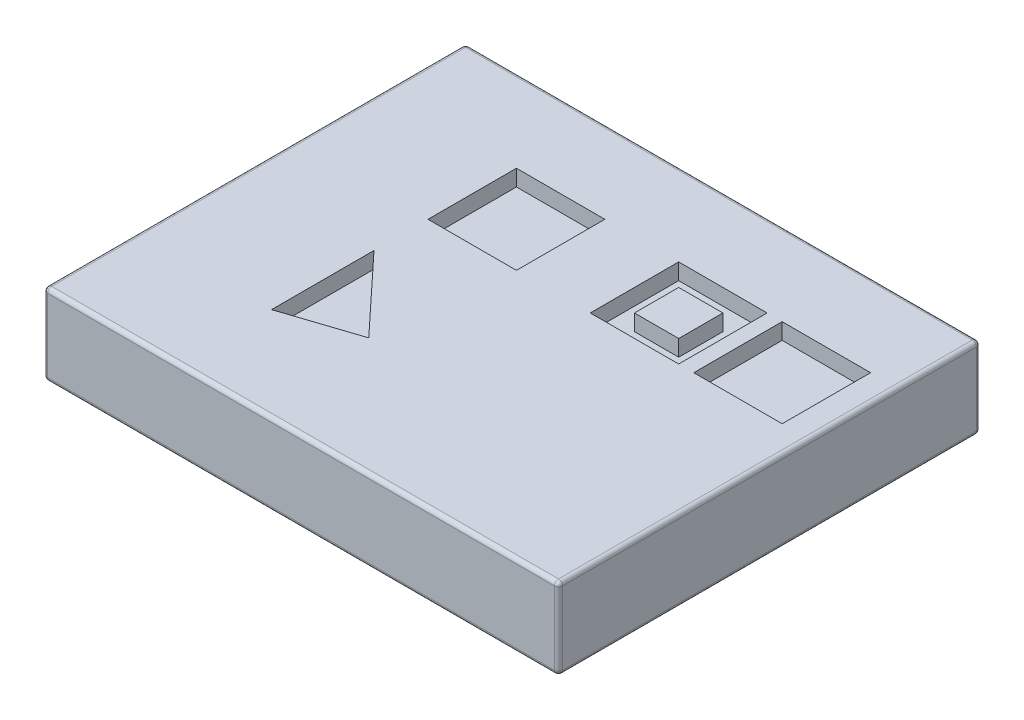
ISO-10303-21;
HEADER;
FILE_DESCRIPTION(('STEP AP214'),'2;1');
FILE_NAME('part.step','',(''),(''),'','','');
FILE_SCHEMA(('AUTOMOTIVE_DESIGN { 1 0 10303 214 1 1 1 1 }'));
ENDSEC;
DATA;
#1=APPLICATION_CONTEXT('core data for automotive mechanical design processes');
#2=APPLICATION_PROTOCOL_DEFINITION('international standard','automotive_design',2000,#1);
#3=PRODUCT_CONTEXT('',#1,'mechanical');
#4=PRODUCT('Part','Part','',(#3));
#5=PRODUCT_RELATED_PRODUCT_CATEGORY('part','',(#4));
#6=PRODUCT_DEFINITION_FORMATION('','',#4);
#7=PRODUCT_DEFINITION_CONTEXT('part definition',#1,'design');
#8=PRODUCT_DEFINITION('design','',#6,#7);
#9=PRODUCT_DEFINITION_SHAPE('','',#8);
#10=(LENGTH_UNIT() NAMED_UNIT(*) SI_UNIT(.MILLI.,.METRE.));
#11=(NAMED_UNIT(*) PLANE_ANGLE_UNIT() SI_UNIT($,.RADIAN.));
#12=(NAMED_UNIT(*) SI_UNIT($,.STERADIAN.) SOLID_ANGLE_UNIT());
#13=UNCERTAINTY_MEASURE_WITH_UNIT(LENGTH_MEASURE(1.E-05),#10,'distance_accuracy_value','');
#14=(GEOMETRIC_REPRESENTATION_CONTEXT(3) GLOBAL_UNCERTAINTY_ASSIGNED_CONTEXT((#13)) GLOBAL_UNIT_ASSIGNED_CONTEXT((#10,
#11,#12)) REPRESENTATION_CONTEXT('',''));
#15=CARTESIAN_POINT('',(0.,0.,0.));
#16=DIRECTION('',(0.,0.,1.));
#17=DIRECTION('',(1.,0.,0.));
#18=AXIS2_PLACEMENT_3D('',#15,#16,#17);
#19=CARTESIAN_POINT('',(0.,10.,-52.0063941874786));
#20=DIRECTION('',(1.,0.,0.));
#21=DIRECTION('',(0.,0.,-1.));
#22=AXIS2_PLACEMENT_3D('',#19,#20,#21);
#23=PLANE('',#22);
#24=DIRECTION('',(0.,0.,1.));
#25=VECTOR('',#24,1.);
#26=CARTESIAN_POINT('',(0.,9.5,-52.0063941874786));
#27=LINE('',#26,#25);
#28=CARTESIAN_POINT('',(0.,9.5,-0.5));
#29=VERTEX_POINT('',#28);
#30=CARTESIAN_POINT('',(0.,9.5,-51.5063941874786));
#31=VERTEX_POINT('',#30);
#32=EDGE_CURVE('E438',#29,#31,#27,.F.);
#33=ORIENTED_EDGE('',*,*,#32,.T.);
#34=DIRECTION('',(0.,-1.,0.));
#35=VECTOR('',#34,1.);
#36=CARTESIAN_POINT('',(0.,10.,-51.5063941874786));
#37=LINE('',#36,#35);
#38=CARTESIAN_POINT('',(0.,0.5,-51.5063941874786));
#39=VERTEX_POINT('',#38);
#40=EDGE_CURVE('E440',#31,#39,#37,.T.);
#41=ORIENTED_EDGE('',*,*,#40,.T.);
#42=DIRECTION('',(0.,0.,1.));
#43=VECTOR('',#42,1.);
#44=CARTESIAN_POINT('',(0.,0.5,-52.0063941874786));
#45=LINE('',#44,#43);
#46=CARTESIAN_POINT('',(0.,0.5,-0.5));
#47=VERTEX_POINT('',#46);
#48=EDGE_CURVE('E436',#39,#47,#45,.T.);
#49=ORIENTED_EDGE('',*,*,#48,.T.);
#50=DIRECTION('',(0.,-1.,0.));
#51=VECTOR('',#50,1.);
#52=CARTESIAN_POINT('',(0.,10.,-0.5));
#53=LINE('',#52,#51);
#54=EDGE_CURVE('E434',#47,#29,#53,.F.);
#55=ORIENTED_EDGE('',*,*,#54,.T.);
#56=EDGE_LOOP('',(#33,#41,#49,#55));
#57=FACE_BOUND('',#56,.T.);
#58=ADVANCED_FACE('F33',(#57),#23,.F.);
#59=CARTESIAN_POINT('',(0.,10.,0.));
#60=DIRECTION('',(0.,0.,-1.));
#61=DIRECTION('',(-1.,0.,0.));
#62=AXIS2_PLACEMENT_3D('',#59,#60,#61);
#63=PLANE('',#62);
#64=DIRECTION('',(1.,0.,0.));
#65=VECTOR('',#64,1.);
#66=CARTESIAN_POINT('',(0.,9.5,0.));
#67=LINE('',#66,#65);
#68=CARTESIAN_POINT('',(62.9654301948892,9.5,0.));
#69=VERTEX_POINT('',#68);
#70=CARTESIAN_POINT('',(0.5,9.5,0.));
#71=VERTEX_POINT('',#70);
#72=EDGE_CURVE('E42',#69,#71,#67,.F.);
#73=ORIENTED_EDGE('',*,*,#72,.T.);
#74=DIRECTION('',(0.,-1.,0.));
#75=VECTOR('',#74,1.);
#76=CARTESIAN_POINT('',(0.5,10.,0.));
#77=LINE('',#76,#75);
#78=CARTESIAN_POINT('',(0.5,0.5,0.));
#79=VERTEX_POINT('',#78);
#80=EDGE_CURVE('E11',#71,#79,#77,.T.);
#81=ORIENTED_EDGE('',*,*,#80,.T.);
#82=DIRECTION('',(1.,0.,0.));
#83=VECTOR('',#82,1.);
#84=CARTESIAN_POINT('',(0.,0.5,0.));
#85=LINE('',#84,#83);
#86=CARTESIAN_POINT('',(62.9654301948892,0.5,0.));
#87=VERTEX_POINT('',#86);
#88=EDGE_CURVE('E443',#79,#87,#85,.T.);
#89=ORIENTED_EDGE('',*,*,#88,.T.);
#90=DIRECTION('',(0.,-1.,0.));
#91=VECTOR('',#90,1.);
#92=CARTESIAN_POINT('',(62.9654301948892,10.,0.));
#93=LINE('',#92,#91);
#94=EDGE_CURVE('E53',#87,#69,#93,.F.);
#95=ORIENTED_EDGE('',*,*,#94,.T.);
#96=EDGE_LOOP('',(#73,#81,#89,#95));
#97=FACE_BOUND('',#96,.T.);
#98=ADVANCED_FACE('F528',(#97),#63,.F.);
#99=CARTESIAN_POINT('',(63.4654301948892,10.,0.));
#100=DIRECTION('',(-1.,0.,0.));
#101=DIRECTION('',(0.,0.,1.));
#102=AXIS2_PLACEMENT_3D('',#99,#100,#101);
#103=PLANE('',#102);
#104=DIRECTION('',(0.,0.,-1.));
#105=VECTOR('',#104,1.);
#106=CARTESIAN_POINT('',(63.4654301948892,0.5,0.));
#107=LINE('',#106,#105);
#108=CARTESIAN_POINT('',(63.4654301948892,0.5,-0.5));
#109=VERTEX_POINT('',#108);
#110=CARTESIAN_POINT('',(63.4654301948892,0.5,-51.5063941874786));
#111=VERTEX_POINT('',#110);
#112=EDGE_CURVE('E409',#109,#111,#107,.T.);
#113=ORIENTED_EDGE('',*,*,#112,.T.);
#114=DIRECTION('',(0.,-1.,0.));
#115=VECTOR('',#114,1.);
#116=CARTESIAN_POINT('',(63.4654301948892,10.,-51.5063941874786));
#117=LINE('',#116,#115);
#118=CARTESIAN_POINT('',(63.4654301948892,9.5,-51.5063941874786));
#119=VERTEX_POINT('',#118);
#120=EDGE_CURVE('E414',#111,#119,#117,.F.);
#121=ORIENTED_EDGE('',*,*,#120,.T.);
#122=DIRECTION('',(0.,0.,-1.));
#123=VECTOR('',#122,1.);
#124=CARTESIAN_POINT('',(63.4654301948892,9.5,0.));
#125=LINE('',#124,#123);
#126=CARTESIAN_POINT('',(63.4654301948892,9.5,-0.5));
#127=VERTEX_POINT('',#126);
#128=EDGE_CURVE('E411',#119,#127,#125,.F.);
#129=ORIENTED_EDGE('',*,*,#128,.T.);
#130=DIRECTION('',(0.,-1.,0.));
#131=VECTOR('',#130,1.);
#132=CARTESIAN_POINT('',(63.4654301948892,10.,-0.5));
#133=LINE('',#132,#131);
#134=EDGE_CURVE('E407',#127,#109,#133,.T.);
#135=ORIENTED_EDGE('',*,*,#134,.T.);
#136=EDGE_LOOP('',(#113,#121,#129,#135));
#137=FACE_BOUND('',#136,.T.);
#138=ADVANCED_FACE('F609',(#137),#103,.F.);
#139=CARTESIAN_POINT('',(63.4654301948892,10.,-52.0063941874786));
#140=DIRECTION('',(0.,0.,1.));
#141=DIRECTION('',(1.,0.,0.));
#142=AXIS2_PLACEMENT_3D('',#139,#140,#141);
#143=PLANE('',#142);
#144=DIRECTION('',(-1.,0.,0.));
#145=VECTOR('',#144,1.);
#146=CARTESIAN_POINT('',(63.4654301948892,9.5,-52.0063941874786));
#147=LINE('',#146,#145);
#148=CARTESIAN_POINT('',(0.5,9.5,-52.0063941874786));
#149=VERTEX_POINT('',#148);
#150=CARTESIAN_POINT('',(62.9654301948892,9.5,-52.0063941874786));
#151=VERTEX_POINT('',#150);
#152=EDGE_CURVE('E429',#149,#151,#147,.F.);
#153=ORIENTED_EDGE('',*,*,#152,.T.);
#154=DIRECTION('',(0.,-1.,0.));
#155=VECTOR('',#154,1.);
#156=CARTESIAN_POINT('',(62.9654301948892,10.,-52.0063941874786));
#157=LINE('',#156,#155);
#158=CARTESIAN_POINT('',(62.9654301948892,0.5,-52.0063941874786));
#159=VERTEX_POINT('',#158);
#160=EDGE_CURVE('E431',#151,#159,#157,.T.);
#161=ORIENTED_EDGE('',*,*,#160,.T.);
#162=DIRECTION('',(-1.,0.,0.));
#163=VECTOR('',#162,1.);
#164=CARTESIAN_POINT('',(63.4654301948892,0.5,-52.0063941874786));
#165=LINE('',#164,#163);
#166=CARTESIAN_POINT('',(0.5,0.5,-52.0063941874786));
#167=VERTEX_POINT('',#166);
#168=EDGE_CURVE('E427',#159,#167,#165,.T.);
#169=ORIENTED_EDGE('',*,*,#168,.T.);
#170=DIRECTION('',(0.,-1.,0.));
#171=VECTOR('',#170,1.);
#172=CARTESIAN_POINT('',(0.5,10.,-52.0063941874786));
#173=LINE('',#172,#171);
#174=EDGE_CURVE('E425',#167,#149,#173,.F.);
#175=ORIENTED_EDGE('',*,*,#174,.T.);
#176=EDGE_LOOP('',(#153,#161,#169,#175));
#177=FACE_BOUND('',#176,.T.);
#178=ADVANCED_FACE('F979',(#177),#143,.F.);
#179=CARTESIAN_POINT('',(0.,10.,0.));
#180=DIRECTION('',(0.,1.,0.));
#181=DIRECTION('',(0.,0.,1.));
#182=AXIS2_PLACEMENT_3D('',#179,#180,#181);
#183=PLANE('',#182);
#184=DIRECTION('',(1.,0.,0.));
#185=VECTOR('',#184,1.);
#186=CARTESIAN_POINT('',(63.4654301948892,10.,-0.5));
#187=LINE('',#186,#185);
#188=CARTESIAN_POINT('',(0.5,10.,-0.5));
#189=VERTEX_POINT('',#188);
#190=CARTESIAN_POINT('',(62.9654301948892,10.,-0.5));
#191=VERTEX_POINT('',#190);
#192=EDGE_CURVE('E392',#189,#191,#187,.T.);
#193=ORIENTED_EDGE('',*,*,#192,.T.);
#194=DIRECTION('',(0.,0.,-1.));
#195=VECTOR('',#194,1.);
#196=CARTESIAN_POINT('',(62.9654301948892,10.,-52.0063941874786));
#197=LINE('',#196,#195);
#198=CARTESIAN_POINT('',(62.9654301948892,10.,-51.5063941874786));
#199=VERTEX_POINT('',#198);
#200=EDGE_CURVE('E404',#191,#199,#197,.T.);
#201=ORIENTED_EDGE('',*,*,#200,.T.);
#202=DIRECTION('',(-1.,0.,0.));
#203=VECTOR('',#202,1.);
#204=CARTESIAN_POINT('',(0.,10.,-51.5063941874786));
#205=LINE('',#204,#203);
#206=CARTESIAN_POINT('',(0.5,10.,-51.5063941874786));
#207=VERTEX_POINT('',#206);
#208=EDGE_CURVE('E402',#199,#207,#205,.T.);
#209=ORIENTED_EDGE('',*,*,#208,.T.);
#210=DIRECTION('',(0.,0.,1.));
#211=VECTOR('',#210,1.);
#212=CARTESIAN_POINT('',(0.5,10.,0.));
#213=LINE('',#212,#211);
#214=EDGE_CURVE('E400',#207,#189,#213,.T.);
#215=ORIENTED_EDGE('',*,*,#214,.T.);
#216=EDGE_LOOP('',(#193,#201,#209,#215));
#217=FACE_BOUND('',#216,.T.);
#218=DIRECTION('',(-1.,0.,0.));
#219=VECTOR('',#218,1.);
#220=CARTESIAN_POINT('',(49.2891276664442,10.,-41.7479060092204));
#221=LINE('',#220,#219);
#222=CARTESIAN_POINT('',(60.1886709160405,10.,-41.7479060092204));
#223=VERTEX_POINT('',#222);
#224=CARTESIAN_POINT('',(49.2891276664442,10.,-41.7479060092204));
#225=VERTEX_POINT('',#224);
#226=EDGE_CURVE('E242',#223,#225,#221,.T.);
#227=ORIENTED_EDGE('',*,*,#226,.F.);
#228=DIRECTION('',(0.,0.,-1.));
#229=VECTOR('',#228,1.);
#230=CARTESIAN_POINT('',(60.1886709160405,10.,-41.7479060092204));
#231=LINE('',#230,#229);
#232=CARTESIAN_POINT('',(60.1886709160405,10.,-30.8483627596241));
#233=VERTEX_POINT('',#232);
#234=EDGE_CURVE('E259',#233,#223,#231,.T.);
#235=ORIENTED_EDGE('',*,*,#234,.F.);
#236=DIRECTION('',(1.,0.,0.));
#237=VECTOR('',#236,1.);
#238=CARTESIAN_POINT('',(60.1886709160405,10.,-30.8483627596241));
#239=LINE('',#238,#237);
#240=CARTESIAN_POINT('',(49.2891276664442,10.,-30.8483627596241));
#241=VERTEX_POINT('',#240);
#242=EDGE_CURVE('E262',#241,#233,#239,.T.);
#243=ORIENTED_EDGE('',*,*,#242,.F.);
#244=DIRECTION('',(0.,0.,1.));
#245=VECTOR('',#244,1.);
#246=CARTESIAN_POINT('',(49.2891276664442,10.,-30.8483627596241));
#247=LINE('',#246,#245);
#248=EDGE_CURVE('E268',#225,#241,#247,.T.);
#249=ORIENTED_EDGE('',*,*,#248,.F.);
#250=EDGE_LOOP('',(#227,#235,#243,#249));
#251=FACE_BOUND('',#250,.T.);
#252=DIRECTION('',(0.,0.,1.));
#253=VECTOR('',#252,1.);
#254=CARTESIAN_POINT('',(36.5347862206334,10.,-30.8483627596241));
#255=LINE('',#254,#253);
#256=CARTESIAN_POINT('',(36.5347862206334,10.,-41.7479060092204));
#257=VERTEX_POINT('',#256);
#258=CARTESIAN_POINT('',(36.5347862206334,10.,-30.8483627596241));
#259=VERTEX_POINT('',#258);
#260=EDGE_CURVE('E304',#257,#259,#255,.T.);
#261=ORIENTED_EDGE('',*,*,#260,.F.);
#262=DIRECTION('',(-1.,0.,0.));
#263=VECTOR('',#262,1.);
#264=CARTESIAN_POINT('',(36.5347862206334,10.,-41.7479060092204));
#265=LINE('',#264,#263);
#266=CARTESIAN_POINT('',(47.4343294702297,10.,-41.7479060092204));
#267=VERTEX_POINT('',#266);
#268=EDGE_CURVE('E315',#267,#257,#265,.T.);
#269=ORIENTED_EDGE('',*,*,#268,.F.);
#270=DIRECTION('',(0.,0.,-1.));
#271=VECTOR('',#270,1.);
#272=CARTESIAN_POINT('',(47.4343294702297,10.,-41.7479060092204));
#273=LINE('',#272,#271);
#274=CARTESIAN_POINT('',(47.4343294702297,10.,-30.8483627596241));
#275=VERTEX_POINT('',#274);
#276=EDGE_CURVE('E329',#275,#267,#273,.T.);
#277=ORIENTED_EDGE('',*,*,#276,.F.);
#278=DIRECTION('',(1.,0.,0.));
#279=VECTOR('',#278,1.);
#280=CARTESIAN_POINT('',(47.4343294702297,10.,-30.8483627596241));
#281=LINE('',#280,#279);
#282=EDGE_CURVE('E326',#259,#275,#281,.T.);
#283=ORIENTED_EDGE('',*,*,#282,.F.);
#284=EDGE_LOOP('',(#261,#269,#277,#283));
#285=FACE_BOUND('',#284,.T.);
#286=DIRECTION('',(0.949483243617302,0.,-0.313817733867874));
#287=VECTOR('',#286,1.);
#288=CARTESIAN_POINT('',(25.5381401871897,10.,-14.5382504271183));
#289=LINE('',#288,#287);
#290=CARTESIAN_POINT('',(16.5347862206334,10.,-11.5625137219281));
#291=VERTEX_POINT('',#290);
#292=CARTESIAN_POINT('',(25.5381401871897,10.,-14.5382504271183));
#293=VERTEX_POINT('',#292);
#294=EDGE_CURVE('E336',#291,#293,#289,.T.);
#295=ORIENTED_EDGE('',*,*,#294,.F.);
#296=DIRECTION('',(0.,0.,1.));
#297=VECTOR('',#296,1.);
#298=CARTESIAN_POINT('',(16.5347862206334,10.,-11.5625137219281));
#299=LINE('',#298,#297);
#300=CARTESIAN_POINT('',(16.5347862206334,10.,-24.1912873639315));
#301=VERTEX_POINT('',#300);
#302=EDGE_CURVE('E347',#301,#291,#299,.T.);
#303=ORIENTED_EDGE('',*,*,#302,.F.);
#304=DIRECTION('',(-0.682069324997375,0.,-0.731287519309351));
#305=VECTOR('',#304,1.);
#306=CARTESIAN_POINT('',(16.5347862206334,10.,-24.1912873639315));
#307=LINE('',#306,#305);
#308=EDGE_CURVE('E355',#293,#301,#307,.T.);
#309=ORIENTED_EDGE('',*,*,#308,.F.);
#310=EDGE_LOOP('',(#295,#303,#309));
#311=FACE_BOUND('',#310,.T.);
#312=DIRECTION('',(0.,0.,1.));
#313=VECTOR('',#312,1.);
#314=CARTESIAN_POINT('',(16.5347862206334,10.,-30.8483627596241));
#315=LINE('',#314,#313);
#316=CARTESIAN_POINT('',(16.5347862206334,10.,-41.7479060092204));
#317=VERTEX_POINT('',#316);
#318=CARTESIAN_POINT('',(16.5347862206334,10.,-30.8483627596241));
#319=VERTEX_POINT('',#318);
#320=EDGE_CURVE('E362',#317,#319,#315,.T.);
#321=ORIENTED_EDGE('',*,*,#320,.F.);
#322=DIRECTION('',(-1.,0.,0.));
#323=VECTOR('',#322,1.);
#324=CARTESIAN_POINT('',(16.5347862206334,10.,-41.7479060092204));
#325=LINE('',#324,#323);
#326=CARTESIAN_POINT('',(27.4343294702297,10.,-41.7479060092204));
#327=VERTEX_POINT('',#326);
#328=EDGE_CURVE('E371',#327,#317,#325,.T.);
#329=ORIENTED_EDGE('',*,*,#328,.F.);
#330=DIRECTION('',(0.,0.,-1.));
#331=VECTOR('',#330,1.);
#332=CARTESIAN_POINT('',(27.4343294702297,10.,-41.7479060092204));
#333=LINE('',#332,#331);
#334=CARTESIAN_POINT('',(27.4343294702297,10.,-30.8483627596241));
#335=VERTEX_POINT('',#334);
#336=EDGE_CURVE('E385',#335,#327,#333,.T.);
#337=ORIENTED_EDGE('',*,*,#336,.F.);
#338=DIRECTION('',(1.,0.,0.));
#339=VECTOR('',#338,1.);
#340=CARTESIAN_POINT('',(27.4343294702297,10.,-30.8483627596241));
#341=LINE('',#340,#339);
#342=EDGE_CURVE('E382',#319,#335,#341,.T.);
#343=ORIENTED_EDGE('',*,*,#342,.F.);
#344=EDGE_LOOP('',(#321,#329,#337,#343));
#345=FACE_BOUND('',#344,.T.);
#346=ADVANCED_FACE('F543',(#217,#251,#285,#311,#345),#183,.T.);
#347=CARTESIAN_POINT('',(0.,0.,0.));
#348=DIRECTION('',(0.,1.,0.));
#349=DIRECTION('',(0.,0.,1.));
#350=AXIS2_PLACEMENT_3D('',#347,#348,#349);
#351=PLANE('',#350);
#352=DIRECTION('',(-1.,0.,0.));
#353=VECTOR('',#352,1.);
#354=CARTESIAN_POINT('',(0.,0.,-51.5063941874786));
#355=LINE('',#354,#353);
#356=CARTESIAN_POINT('',(0.5,0.,-51.5063941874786));
#357=VERTEX_POINT('',#356);
#358=CARTESIAN_POINT('',(62.9654301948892,0.,-51.5063941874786));
#359=VERTEX_POINT('',#358);
#360=EDGE_CURVE('E420',#357,#359,#355,.F.);
#361=ORIENTED_EDGE('',*,*,#360,.T.);
#362=DIRECTION('',(0.,0.,-1.));
#363=VECTOR('',#362,1.);
#364=CARTESIAN_POINT('',(62.9654301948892,0.,0.));
#365=LINE('',#364,#363);
#366=CARTESIAN_POINT('',(62.9654301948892,0.,-0.5));
#367=VERTEX_POINT('',#366);
#368=EDGE_CURVE('E422',#359,#367,#365,.F.);
#369=ORIENTED_EDGE('',*,*,#368,.T.);
#370=DIRECTION('',(1.,0.,0.));
#371=VECTOR('',#370,1.);
#372=CARTESIAN_POINT('',(0.,0.,-0.5));
#373=LINE('',#372,#371);
#374=CARTESIAN_POINT('',(0.5,0.,-0.5));
#375=VERTEX_POINT('',#374);
#376=EDGE_CURVE('E416',#367,#375,#373,.F.);
#377=ORIENTED_EDGE('',*,*,#376,.T.);
#378=DIRECTION('',(0.,0.,1.));
#379=VECTOR('',#378,1.);
#380=CARTESIAN_POINT('',(0.5,0.,0.));
#381=LINE('',#380,#379);
#382=EDGE_CURVE('E418',#375,#357,#381,.F.);
#383=ORIENTED_EDGE('',*,*,#382,.T.);
#384=EDGE_LOOP('',(#361,#369,#377,#383));
#385=FACE_BOUND('',#384,.T.);
#386=ADVANCED_FACE('F567',(#385),#351,.F.);
#387=CARTESIAN_POINT('',(16.5347862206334,8.,-30.8483627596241));
#388=DIRECTION('',(-1.,0.,0.));
#389=DIRECTION('',(0.,0.,1.));
#390=AXIS2_PLACEMENT_3D('',#387,#388,#389);
#391=PLANE('',#390);
#392=ORIENTED_EDGE('',*,*,#320,.T.);
#393=DIRECTION('',(0.,1.,0.));
#394=VECTOR('',#393,1.);
#395=CARTESIAN_POINT('',(16.5347862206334,8.,-30.8483627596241));
#396=LINE('',#395,#394);
#397=CARTESIAN_POINT('',(16.5347862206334,8.,-30.8483627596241));
#398=VERTEX_POINT('',#397);
#399=EDGE_CURVE('E380',#398,#319,#396,.T.);
#400=ORIENTED_EDGE('',*,*,#399,.F.);
#401=DIRECTION('',(0.,0.,1.));
#402=VECTOR('',#401,1.);
#403=CARTESIAN_POINT('',(16.5347862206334,8.,-30.8483627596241));
#404=LINE('',#403,#402);
#405=CARTESIAN_POINT('',(16.5347862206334,8.,-41.7479060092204));
#406=VERTEX_POINT('',#405);
#407=EDGE_CURVE('E367',#406,#398,#404,.T.);
#408=ORIENTED_EDGE('',*,*,#407,.F.);
#409=DIRECTION('',(0.,1.,0.));
#410=VECTOR('',#409,1.);
#411=CARTESIAN_POINT('',(16.5347862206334,8.,-41.7479060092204));
#412=LINE('',#411,#410);
#413=EDGE_CURVE('E390',#406,#317,#412,.T.);
#414=ORIENTED_EDGE('',*,*,#413,.T.);
#415=EDGE_LOOP('',(#392,#400,#408,#414));
#416=FACE_BOUND('',#415,.T.);
#417=ADVANCED_FACE('F949',(#416),#391,.F.);
#418=CARTESIAN_POINT('',(16.5347862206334,8.,-41.7479060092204));
#419=DIRECTION('',(0.,0.,-1.));
#420=DIRECTION('',(-1.,0.,0.));
#421=AXIS2_PLACEMENT_3D('',#418,#419,#420);
#422=PLANE('',#421);
#423=ORIENTED_EDGE('',*,*,#328,.T.);
#424=ORIENTED_EDGE('',*,*,#413,.F.);
#425=DIRECTION('',(-1.,0.,0.));
#426=VECTOR('',#425,1.);
#427=CARTESIAN_POINT('',(16.5347862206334,8.,-41.7479060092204));
#428=LINE('',#427,#426);
#429=CARTESIAN_POINT('',(27.4343294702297,8.,-41.7479060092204));
#430=VERTEX_POINT('',#429);
#431=EDGE_CURVE('E377',#430,#406,#428,.T.);
#432=ORIENTED_EDGE('',*,*,#431,.F.);
#433=DIRECTION('',(0.,1.,0.));
#434=VECTOR('',#433,1.);
#435=CARTESIAN_POINT('',(27.4343294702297,8.,-41.7479060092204));
#436=LINE('',#435,#434);
#437=EDGE_CURVE('E393',#430,#327,#436,.T.);
#438=ORIENTED_EDGE('',*,*,#437,.T.);
#439=EDGE_LOOP('',(#423,#424,#432,#438));
#440=FACE_BOUND('',#439,.T.);
#441=ADVANCED_FACE('F940',(#440),#422,.F.);
#442=CARTESIAN_POINT('',(27.4343294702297,8.,-41.7479060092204));
#443=DIRECTION('',(1.,0.,0.));
#444=DIRECTION('',(0.,0.,-1.));
#445=AXIS2_PLACEMENT_3D('',#442,#443,#444);
#446=PLANE('',#445);
#447=ORIENTED_EDGE('',*,*,#336,.T.);
#448=ORIENTED_EDGE('',*,*,#437,.F.);
#449=DIRECTION('',(0.,0.,-1.));
#450=VECTOR('',#449,1.);
#451=CARTESIAN_POINT('',(27.4343294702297,8.,-41.7479060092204));
#452=LINE('',#451,#450);
#453=CARTESIAN_POINT('',(27.4343294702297,8.,-30.8483627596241));
#454=VERTEX_POINT('',#453);
#455=EDGE_CURVE('E374',#454,#430,#452,.T.);
#456=ORIENTED_EDGE('',*,*,#455,.F.);
#457=DIRECTION('',(0.,1.,0.));
#458=VECTOR('',#457,1.);
#459=CARTESIAN_POINT('',(27.4343294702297,8.,-30.8483627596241));
#460=LINE('',#459,#458);
#461=EDGE_CURVE('E395',#454,#335,#460,.T.);
#462=ORIENTED_EDGE('',*,*,#461,.T.);
#463=EDGE_LOOP('',(#447,#448,#456,#462));
#464=FACE_BOUND('',#463,.T.);
#465=ADVANCED_FACE('F931',(#464),#446,.F.);
#466=CARTESIAN_POINT('',(27.4343294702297,8.,-30.8483627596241));
#467=DIRECTION('',(0.,0.,1.));
#468=DIRECTION('',(1.,0.,0.));
#469=AXIS2_PLACEMENT_3D('',#466,#467,#468);
#470=PLANE('',#469);
#471=ORIENTED_EDGE('',*,*,#342,.T.);
#472=ORIENTED_EDGE('',*,*,#461,.F.);
#473=DIRECTION('',(1.,0.,0.));
#474=VECTOR('',#473,1.);
#475=CARTESIAN_POINT('',(27.4343294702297,8.,-30.8483627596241));
#476=LINE('',#475,#474);
#477=EDGE_CURVE('E370',#398,#454,#476,.T.);
#478=ORIENTED_EDGE('',*,*,#477,.F.);
#479=ORIENTED_EDGE('',*,*,#399,.T.);
#480=EDGE_LOOP('',(#471,#472,#478,#479));
#481=FACE_BOUND('',#480,.T.);
#482=ADVANCED_FACE('F922',(#481),#470,.F.);
#483=CARTESIAN_POINT('',(0.,8.,0.));
#484=DIRECTION('',(0.,-1.,0.));
#485=DIRECTION('',(0.,0.,-1.));
#486=AXIS2_PLACEMENT_3D('',#483,#484,#485);
#487=PLANE('',#486);
#488=ORIENTED_EDGE('',*,*,#407,.T.);
#489=ORIENTED_EDGE('',*,*,#477,.T.);
#490=ORIENTED_EDGE('',*,*,#455,.T.);
#491=ORIENTED_EDGE('',*,*,#431,.T.);
#492=EDGE_LOOP('',(#488,#489,#490,#491));
#493=FACE_BOUND('',#492,.T.);
#494=ADVANCED_FACE('F913',(#493),#487,.F.);
#495=CARTESIAN_POINT('',(25.5381401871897,8.,-14.5382504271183));
#496=DIRECTION('',(0.313817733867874,0.,0.949483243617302));
#497=DIRECTION('',(0.949483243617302,0.,-0.313817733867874));
#498=AXIS2_PLACEMENT_3D('',#495,#496,#497);
#499=PLANE('',#498);
#500=ORIENTED_EDGE('',*,*,#294,.T.);
#501=DIRECTION('',(0.,1.,0.));
#502=VECTOR('',#501,1.);
#503=CARTESIAN_POINT('',(25.5381401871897,8.,-14.5382504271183));
#504=LINE('',#503,#502);
#505=CARTESIAN_POINT('',(25.5381401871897,8.,-14.5382504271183));
#506=VERTEX_POINT('',#505);
#507=EDGE_CURVE('E353',#506,#293,#504,.T.);
#508=ORIENTED_EDGE('',*,*,#507,.F.);
#509=DIRECTION('',(0.949483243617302,0.,-0.313817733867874));
#510=VECTOR('',#509,1.);
#511=CARTESIAN_POINT('',(25.5381401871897,8.,-14.5382504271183));
#512=LINE('',#511,#510);
#513=CARTESIAN_POINT('',(16.5347862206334,8.,-11.5625137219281));
#514=VERTEX_POINT('',#513);
#515=EDGE_CURVE('E343',#514,#506,#512,.T.);
#516=ORIENTED_EDGE('',*,*,#515,.F.);
#517=DIRECTION('',(0.,1.,0.));
#518=VECTOR('',#517,1.);
#519=CARTESIAN_POINT('',(16.5347862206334,8.,-11.5625137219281));
#520=LINE('',#519,#518);
#521=EDGE_CURVE('E360',#514,#291,#520,.T.);
#522=ORIENTED_EDGE('',*,*,#521,.T.);
#523=EDGE_LOOP('',(#500,#508,#516,#522));
#524=FACE_BOUND('',#523,.T.);
#525=ADVANCED_FACE('F904',(#524),#499,.F.);
#526=CARTESIAN_POINT('',(16.5347862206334,8.,-11.5625137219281));
#527=DIRECTION('',(-1.,0.,0.));
#528=DIRECTION('',(0.,0.,1.));
#529=AXIS2_PLACEMENT_3D('',#526,#527,#528);
#530=PLANE('',#529);
#531=ORIENTED_EDGE('',*,*,#302,.T.);
#532=ORIENTED_EDGE('',*,*,#521,.F.);
#533=DIRECTION('',(0.,0.,1.));
#534=VECTOR('',#533,1.);
#535=CARTESIAN_POINT('',(16.5347862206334,8.,-11.5625137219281));
#536=LINE('',#535,#534);
#537=CARTESIAN_POINT('',(16.5347862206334,8.,-24.1912873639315));
#538=VERTEX_POINT('',#537);
#539=EDGE_CURVE('E350',#538,#514,#536,.T.);
#540=ORIENTED_EDGE('',*,*,#539,.F.);
#541=DIRECTION('',(0.,1.,0.));
#542=VECTOR('',#541,1.);
#543=CARTESIAN_POINT('',(16.5347862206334,8.,-24.1912873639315));
#544=LINE('',#543,#542);
#545=EDGE_CURVE('E363',#538,#301,#544,.T.);
#546=ORIENTED_EDGE('',*,*,#545,.T.);
#547=EDGE_LOOP('',(#531,#532,#540,#546));
#548=FACE_BOUND('',#547,.T.);
#549=ADVANCED_FACE('F895',(#548),#530,.F.);
#550=CARTESIAN_POINT('',(16.5347862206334,8.,-24.1912873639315));
#551=DIRECTION('',(0.731287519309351,0.,-0.682069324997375));
#552=DIRECTION('',(-0.682069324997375,0.,-0.731287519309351));
#553=AXIS2_PLACEMENT_3D('',#550,#551,#552);
#554=PLANE('',#553);
#555=ORIENTED_EDGE('',*,*,#308,.T.);
#556=ORIENTED_EDGE('',*,*,#545,.F.);
#557=DIRECTION('',(-0.682069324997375,0.,-0.731287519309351));
#558=VECTOR('',#557,1.);
#559=CARTESIAN_POINT('',(16.5347862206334,8.,-24.1912873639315));
#560=LINE('',#559,#558);
#561=EDGE_CURVE('E346',#506,#538,#560,.T.);
#562=ORIENTED_EDGE('',*,*,#561,.F.);
#563=ORIENTED_EDGE('',*,*,#507,.T.);
#564=EDGE_LOOP('',(#555,#556,#562,#563));
#565=FACE_BOUND('',#564,.T.);
#566=ADVANCED_FACE('F886',(#565),#554,.F.);
#567=CARTESIAN_POINT('',(0.,8.,0.));
#568=DIRECTION('',(0.,-1.,0.));
#569=DIRECTION('',(0.,0.,-1.));
#570=AXIS2_PLACEMENT_3D('',#567,#568,#569);
#571=PLANE('',#570);
#572=ORIENTED_EDGE('',*,*,#515,.T.);
#573=ORIENTED_EDGE('',*,*,#561,.T.);
#574=ORIENTED_EDGE('',*,*,#539,.T.);
#575=EDGE_LOOP('',(#572,#573,#574));
#576=FACE_BOUND('',#575,.T.);
#577=ADVANCED_FACE('F877',(#576),#571,.F.);
#578=CARTESIAN_POINT('',(36.5347862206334,8.,-30.8483627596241));
#579=DIRECTION('',(-1.,0.,0.));
#580=DIRECTION('',(0.,0.,1.));
#581=AXIS2_PLACEMENT_3D('',#578,#579,#580);
#582=PLANE('',#581);
#583=ORIENTED_EDGE('',*,*,#260,.T.);
#584=DIRECTION('',(0.,1.,0.));
#585=VECTOR('',#584,1.);
#586=CARTESIAN_POINT('',(36.5347862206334,8.,-30.8483627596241));
#587=LINE('',#586,#585);
#588=CARTESIAN_POINT('',(36.5347862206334,8.,-30.8483627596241));
#589=VERTEX_POINT('',#588);
#590=EDGE_CURVE('E324',#589,#259,#587,.T.);
#591=ORIENTED_EDGE('',*,*,#590,.F.);
#592=DIRECTION('',(0.,0.,1.));
#593=VECTOR('',#592,1.);
#594=CARTESIAN_POINT('',(36.5347862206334,8.,-30.8483627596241));
#595=LINE('',#594,#593);
#596=CARTESIAN_POINT('',(36.5347862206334,8.,-41.7479060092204));
#597=VERTEX_POINT('',#596);
#598=EDGE_CURVE('E311',#597,#589,#595,.T.);
#599=ORIENTED_EDGE('',*,*,#598,.F.);
#600=DIRECTION('',(0.,1.,0.));
#601=VECTOR('',#600,1.);
#602=CARTESIAN_POINT('',(36.5347862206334,8.,-41.7479060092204));
#603=LINE('',#602,#601);
#604=EDGE_CURVE('E334',#597,#257,#603,.T.);
#605=ORIENTED_EDGE('',*,*,#604,.T.);
#606=EDGE_LOOP('',(#583,#591,#599,#605));
#607=FACE_BOUND('',#606,.T.);
#608=ADVANCED_FACE('F868',(#607),#582,.F.);
#609=CARTESIAN_POINT('',(36.5347862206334,8.,-41.7479060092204));
#610=DIRECTION('',(0.,0.,-1.));
#611=DIRECTION('',(-1.,0.,0.));
#612=AXIS2_PLACEMENT_3D('',#609,#610,#611);
#613=PLANE('',#612);
#614=ORIENTED_EDGE('',*,*,#268,.T.);
#615=ORIENTED_EDGE('',*,*,#604,.F.);
#616=DIRECTION('',(-1.,0.,0.));
#617=VECTOR('',#616,1.);
#618=CARTESIAN_POINT('',(36.5347862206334,8.,-41.7479060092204));
#619=LINE('',#618,#617);
#620=CARTESIAN_POINT('',(47.4343294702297,8.,-41.7479060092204));
#621=VERTEX_POINT('',#620);
#622=EDGE_CURVE('E321',#621,#597,#619,.T.);
#623=ORIENTED_EDGE('',*,*,#622,.F.);
#624=DIRECTION('',(0.,1.,0.));
#625=VECTOR('',#624,1.);
#626=CARTESIAN_POINT('',(47.4343294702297,8.,-41.7479060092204));
#627=LINE('',#626,#625);
#628=EDGE_CURVE('E337',#621,#267,#627,.T.);
#629=ORIENTED_EDGE('',*,*,#628,.T.);
#630=EDGE_LOOP('',(#614,#615,#623,#629));
#631=FACE_BOUND('',#630,.T.);
#632=ADVANCED_FACE('F859',(#631),#613,.F.);
#633=CARTESIAN_POINT('',(47.4343294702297,8.,-41.7479060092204));
#634=DIRECTION('',(1.,0.,0.));
#635=DIRECTION('',(0.,0.,-1.));
#636=AXIS2_PLACEMENT_3D('',#633,#634,#635);
#637=PLANE('',#636);
#638=ORIENTED_EDGE('',*,*,#276,.T.);
#639=ORIENTED_EDGE('',*,*,#628,.F.);
#640=DIRECTION('',(0.,0.,-1.));
#641=VECTOR('',#640,1.);
#642=CARTESIAN_POINT('',(47.4343294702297,8.,-41.7479060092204));
#643=LINE('',#642,#641);
#644=CARTESIAN_POINT('',(47.4343294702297,8.,-30.8483627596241));
#645=VERTEX_POINT('',#644);
#646=EDGE_CURVE('E318',#645,#621,#643,.T.);
#647=ORIENTED_EDGE('',*,*,#646,.F.);
#648=DIRECTION('',(0.,1.,0.));
#649=VECTOR('',#648,1.);
#650=CARTESIAN_POINT('',(47.4343294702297,8.,-30.8483627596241));
#651=LINE('',#650,#649);
#652=EDGE_CURVE('E339',#645,#275,#651,.T.);
#653=ORIENTED_EDGE('',*,*,#652,.T.);
#654=EDGE_LOOP('',(#638,#639,#647,#653));
#655=FACE_BOUND('',#654,.T.);
#656=ADVANCED_FACE('F850',(#655),#637,.F.);
#657=CARTESIAN_POINT('',(47.4343294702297,8.,-30.8483627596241));
#658=DIRECTION('',(0.,0.,1.));
#659=DIRECTION('',(1.,0.,0.));
#660=AXIS2_PLACEMENT_3D('',#657,#658,#659);
#661=PLANE('',#660);
#662=ORIENTED_EDGE('',*,*,#282,.T.);
#663=ORIENTED_EDGE('',*,*,#652,.F.);
#664=DIRECTION('',(1.,0.,0.));
#665=VECTOR('',#664,1.);
#666=CARTESIAN_POINT('',(47.4343294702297,8.,-30.8483627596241));
#667=LINE('',#666,#665);
#668=EDGE_CURVE('E314',#589,#645,#667,.T.);
#669=ORIENTED_EDGE('',*,*,#668,.F.);
#670=ORIENTED_EDGE('',*,*,#590,.T.);
#671=EDGE_LOOP('',(#662,#663,#669,#670));
#672=FACE_BOUND('',#671,.T.);
#673=ADVANCED_FACE('F841',(#672),#661,.F.);
#674=CARTESIAN_POINT('',(0.,8.,0.));
#675=DIRECTION('',(0.,-1.,0.));
#676=DIRECTION('',(0.,0.,-1.));
#677=AXIS2_PLACEMENT_3D('',#674,#675,#676);
#678=PLANE('',#677);
#679=DIRECTION('',(-1.,0.,0.));
#680=VECTOR('',#679,1.);
#681=CARTESIAN_POINT('',(39.2596720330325,8.,-39.0230201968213));
#682=LINE('',#681,#680);
#683=CARTESIAN_POINT('',(44.7094436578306,8.,-39.0230201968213));
#684=VERTEX_POINT('',#683);
#685=CARTESIAN_POINT('',(39.2596720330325,8.,-39.0230201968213));
#686=VERTEX_POINT('',#685);
#687=EDGE_CURVE('E278',#684,#686,#682,.T.);
#688=ORIENTED_EDGE('',*,*,#687,.F.);
#689=DIRECTION('',(0.,0.,-1.));
#690=VECTOR('',#689,1.);
#691=CARTESIAN_POINT('',(44.7094436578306,8.,-39.0230201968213));
#692=LINE('',#691,#690);
#693=CARTESIAN_POINT('',(44.7094436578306,8.,-33.5732485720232));
#694=VERTEX_POINT('',#693);
#695=EDGE_CURVE('E288',#694,#684,#692,.T.);
#696=ORIENTED_EDGE('',*,*,#695,.F.);
#697=DIRECTION('',(1.,0.,0.));
#698=VECTOR('',#697,1.);
#699=CARTESIAN_POINT('',(44.7094436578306,8.,-33.5732485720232));
#700=LINE('',#699,#698);
#701=CARTESIAN_POINT('',(39.2596720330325,8.,-33.5732485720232));
#702=VERTEX_POINT('',#701);
#703=EDGE_CURVE('E285',#702,#694,#700,.T.);
#704=ORIENTED_EDGE('',*,*,#703,.F.);
#705=DIRECTION('',(0.,0.,1.));
#706=VECTOR('',#705,1.);
#707=CARTESIAN_POINT('',(39.2596720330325,8.,-33.5732485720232));
#708=LINE('',#707,#706);
#709=EDGE_CURVE('E281',#686,#702,#708,.T.);
#710=ORIENTED_EDGE('',*,*,#709,.F.);
#711=EDGE_LOOP('',(#688,#696,#704,#710));
#712=FACE_BOUND('',#711,.T.);
#713=ORIENTED_EDGE('',*,*,#598,.T.);
#714=ORIENTED_EDGE('',*,*,#668,.T.);
#715=ORIENTED_EDGE('',*,*,#646,.T.);
#716=ORIENTED_EDGE('',*,*,#622,.T.);
#717=EDGE_LOOP('',(#713,#714,#715,#716));
#718=FACE_BOUND('',#717,.T.);
#719=ADVANCED_FACE('F832',(#712,#718),#678,.F.);
#720=CARTESIAN_POINT('',(39.2596720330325,8.,-39.0230201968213));
#721=DIRECTION('',(0.,0.,-1.));
#722=DIRECTION('',(-1.,0.,0.));
#723=AXIS2_PLACEMENT_3D('',#720,#721,#722);
#724=PLANE('',#723);
#725=DIRECTION('',(-1.,0.,0.));
#726=VECTOR('',#725,1.);
#727=CARTESIAN_POINT('',(39.2596720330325,10.,-39.0230201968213));
#728=LINE('',#727,#726);
#729=CARTESIAN_POINT('',(44.7094436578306,10.,-39.0230201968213));
#730=VERTEX_POINT('',#729);
#731=CARTESIAN_POINT('',(39.2596720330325,10.,-39.0230201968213));
#732=VERTEX_POINT('',#731);
#733=EDGE_CURVE('E274',#730,#732,#728,.T.);
#734=ORIENTED_EDGE('',*,*,#733,.F.);
#735=DIRECTION('',(0.,1.,0.));
#736=VECTOR('',#735,1.);
#737=CARTESIAN_POINT('',(44.7094436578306,8.,-39.0230201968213));
#738=LINE('',#737,#736);
#739=EDGE_CURVE('E302',#684,#730,#738,.T.);
#740=ORIENTED_EDGE('',*,*,#739,.F.);
#741=ORIENTED_EDGE('',*,*,#687,.T.);
#742=DIRECTION('',(0.,1.,0.));
#743=VECTOR('',#742,1.);
#744=CARTESIAN_POINT('',(39.2596720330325,8.,-39.0230201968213));
#745=LINE('',#744,#743);
#746=EDGE_CURVE('E291',#686,#732,#745,.T.);
#747=ORIENTED_EDGE('',*,*,#746,.T.);
#748=EDGE_LOOP('',(#734,#740,#741,#747));
#749=FACE_BOUND('',#748,.T.);
#750=ADVANCED_FACE('F823',(#749),#724,.T.);
#751=CARTESIAN_POINT('',(44.7094436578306,8.,-39.0230201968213));
#752=DIRECTION('',(1.,0.,0.));
#753=DIRECTION('',(0.,0.,-1.));
#754=AXIS2_PLACEMENT_3D('',#751,#752,#753);
#755=PLANE('',#754);
#756=DIRECTION('',(0.,0.,-1.));
#757=VECTOR('',#756,1.);
#758=CARTESIAN_POINT('',(44.7094436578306,10.,-39.0230201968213));
#759=LINE('',#758,#757);
#760=CARTESIAN_POINT('',(44.7094436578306,10.,-33.5732485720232));
#761=VERTEX_POINT('',#760);
#762=EDGE_CURVE('E282',#761,#730,#759,.T.);
#763=ORIENTED_EDGE('',*,*,#762,.F.);
#764=DIRECTION('',(0.,1.,0.));
#765=VECTOR('',#764,1.);
#766=CARTESIAN_POINT('',(44.7094436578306,8.,-33.5732485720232));
#767=LINE('',#766,#765);
#768=EDGE_CURVE('E305',#694,#761,#767,.T.);
#769=ORIENTED_EDGE('',*,*,#768,.F.);
#770=ORIENTED_EDGE('',*,*,#695,.T.);
#771=ORIENTED_EDGE('',*,*,#739,.T.);
#772=EDGE_LOOP('',(#763,#769,#770,#771));
#773=FACE_BOUND('',#772,.T.);
#774=ADVANCED_FACE('F814',(#773),#755,.T.);
#775=CARTESIAN_POINT('',(44.7094436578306,8.,-33.5732485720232));
#776=DIRECTION('',(0.,0.,1.));
#777=DIRECTION('',(1.,0.,0.));
#778=AXIS2_PLACEMENT_3D('',#775,#776,#777);
#779=PLANE('',#778);
#780=DIRECTION('',(1.,0.,0.));
#781=VECTOR('',#780,1.);
#782=CARTESIAN_POINT('',(44.7094436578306,10.,-33.5732485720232));
#783=LINE('',#782,#781);
#784=CARTESIAN_POINT('',(39.2596720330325,10.,-33.5732485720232));
#785=VERTEX_POINT('',#784);
#786=EDGE_CURVE('E297',#785,#761,#783,.T.);
#787=ORIENTED_EDGE('',*,*,#786,.F.);
#788=DIRECTION('',(0.,1.,0.));
#789=VECTOR('',#788,1.);
#790=CARTESIAN_POINT('',(39.2596720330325,8.,-33.5732485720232));
#791=LINE('',#790,#789);
#792=EDGE_CURVE('E307',#702,#785,#791,.T.);
#793=ORIENTED_EDGE('',*,*,#792,.F.);
#794=ORIENTED_EDGE('',*,*,#703,.T.);
#795=ORIENTED_EDGE('',*,*,#768,.T.);
#796=EDGE_LOOP('',(#787,#793,#794,#795));
#797=FACE_BOUND('',#796,.T.);
#798=ADVANCED_FACE('F805',(#797),#779,.T.);
#799=CARTESIAN_POINT('',(39.2596720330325,8.,-33.5732485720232));
#800=DIRECTION('',(-1.,0.,0.));
#801=DIRECTION('',(0.,0.,1.));
#802=AXIS2_PLACEMENT_3D('',#799,#800,#801);
#803=PLANE('',#802);
#804=DIRECTION('',(0.,0.,1.));
#805=VECTOR('',#804,1.);
#806=CARTESIAN_POINT('',(39.2596720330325,10.,-33.5732485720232));
#807=LINE('',#806,#805);
#808=EDGE_CURVE('E294',#732,#785,#807,.T.);
#809=ORIENTED_EDGE('',*,*,#808,.F.);
#810=ORIENTED_EDGE('',*,*,#746,.F.);
#811=ORIENTED_EDGE('',*,*,#709,.T.);
#812=ORIENTED_EDGE('',*,*,#792,.T.);
#813=EDGE_LOOP('',(#809,#810,#811,#812));
#814=FACE_BOUND('',#813,.T.);
#815=ADVANCED_FACE('F799',(#814),#803,.T.);
#816=ORIENTED_EDGE('',*,*,#762,.T.);
#817=ORIENTED_EDGE('',*,*,#733,.T.);
#818=ORIENTED_EDGE('',*,*,#808,.T.);
#819=ORIENTED_EDGE('',*,*,#786,.T.);
#820=EDGE_LOOP('',(#816,#817,#818,#819));
#821=FACE_BOUND('',#820,.T.);
#822=ADVANCED_FACE('F795',(#821),#183,.T.);
#823=CARTESIAN_POINT('',(49.2891276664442,8.,-41.7479060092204));
#824=DIRECTION('',(0.,0.,-1.));
#825=DIRECTION('',(-1.,0.,0.));
#826=AXIS2_PLACEMENT_3D('',#823,#824,#825);
#827=PLANE('',#826);
#828=ORIENTED_EDGE('',*,*,#226,.T.);
#829=DIRECTION('',(0.,1.,0.));
#830=VECTOR('',#829,1.);
#831=CARTESIAN_POINT('',(49.2891276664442,8.,-41.7479060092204));
#832=LINE('',#831,#830);
#833=CARTESIAN_POINT('',(49.2891276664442,8.,-41.7479060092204));
#834=VERTEX_POINT('',#833);
#835=EDGE_CURVE('E235',#834,#225,#832,.T.);
#836=ORIENTED_EDGE('',*,*,#835,.F.);
#837=DIRECTION('',(-1.,0.,0.));
#838=VECTOR('',#837,1.);
#839=CARTESIAN_POINT('',(49.2891276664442,8.,-41.7479060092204));
#840=LINE('',#839,#838);
#841=CARTESIAN_POINT('',(60.1886709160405,8.,-41.7479060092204));
#842=VERTEX_POINT('',#841);
#843=EDGE_CURVE('E239',#842,#834,#840,.T.);
#844=ORIENTED_EDGE('',*,*,#843,.F.);
#845=DIRECTION('',(0.,1.,0.));
#846=VECTOR('',#845,1.);
#847=CARTESIAN_POINT('',(60.1886709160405,8.,-41.7479060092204));
#848=LINE('',#847,#846);
#849=EDGE_CURVE('E272',#842,#223,#848,.T.);
#850=ORIENTED_EDGE('',*,*,#849,.T.);
#851=EDGE_LOOP('',(#828,#836,#844,#850));
#852=FACE_BOUND('',#851,.T.);
#853=ADVANCED_FACE('F237',(#852),#827,.F.);
#854=CARTESIAN_POINT('',(60.1886709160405,8.,-41.7479060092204));
#855=DIRECTION('',(1.,0.,0.));
#856=DIRECTION('',(0.,0.,-1.));
#857=AXIS2_PLACEMENT_3D('',#854,#855,#856);
#858=PLANE('',#857);
#859=ORIENTED_EDGE('',*,*,#234,.T.);
#860=ORIENTED_EDGE('',*,*,#849,.F.);
#861=DIRECTION('',(0.,0.,-1.));
#862=VECTOR('',#861,1.);
#863=CARTESIAN_POINT('',(60.1886709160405,8.,-41.7479060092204));
#864=LINE('',#863,#862);
#865=CARTESIAN_POINT('',(60.1886709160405,8.,-30.8483627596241));
#866=VERTEX_POINT('',#865);
#867=EDGE_CURVE('E247',#866,#842,#864,.T.);
#868=ORIENTED_EDGE('',*,*,#867,.F.);
#869=DIRECTION('',(0.,1.,0.));
#870=VECTOR('',#869,1.);
#871=CARTESIAN_POINT('',(60.1886709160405,8.,-30.8483627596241));
#872=LINE('',#871,#870);
#873=EDGE_CURVE('E275',#866,#233,#872,.T.);
#874=ORIENTED_EDGE('',*,*,#873,.T.);
#875=EDGE_LOOP('',(#859,#860,#868,#874));
#876=FACE_BOUND('',#875,.T.);
#877=ADVANCED_FACE('F778',(#876),#858,.F.);
#878=CARTESIAN_POINT('',(60.1886709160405,8.,-30.8483627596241));
#879=DIRECTION('',(0.,0.,1.));
#880=DIRECTION('',(1.,0.,0.));
#881=AXIS2_PLACEMENT_3D('',#878,#879,#880);
#882=PLANE('',#881);
#883=ORIENTED_EDGE('',*,*,#242,.T.);
#884=ORIENTED_EDGE('',*,*,#873,.F.);
#885=DIRECTION('',(1.,0.,0.));
#886=VECTOR('',#885,1.);
#887=CARTESIAN_POINT('',(60.1886709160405,8.,-30.8483627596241));
#888=LINE('',#887,#886);
#889=CARTESIAN_POINT('',(49.2891276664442,8.,-30.8483627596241));
#890=VERTEX_POINT('',#889);
#891=EDGE_CURVE('E255',#890,#866,#888,.T.);
#892=ORIENTED_EDGE('',*,*,#891,.F.);
#893=DIRECTION('',(0.,1.,0.));
#894=VECTOR('',#893,1.);
#895=CARTESIAN_POINT('',(49.2891276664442,8.,-30.8483627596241));
#896=LINE('',#895,#894);
#897=EDGE_CURVE('E246',#890,#241,#896,.T.);
#898=ORIENTED_EDGE('',*,*,#897,.T.);
#899=EDGE_LOOP('',(#883,#884,#892,#898));
#900=FACE_BOUND('',#899,.T.);
#901=ADVANCED_FACE('F770',(#900),#882,.F.);
#902=CARTESIAN_POINT('',(49.2891276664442,8.,-30.8483627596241));
#903=DIRECTION('',(-1.,0.,0.));
#904=DIRECTION('',(0.,0.,1.));
#905=AXIS2_PLACEMENT_3D('',#902,#903,#904);
#906=PLANE('',#905);
#907=ORIENTED_EDGE('',*,*,#248,.T.);
#908=ORIENTED_EDGE('',*,*,#897,.F.);
#909=DIRECTION('',(0.,0.,1.));
#910=VECTOR('',#909,1.);
#911=CARTESIAN_POINT('',(49.2891276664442,8.,-30.8483627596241));
#912=LINE('',#911,#910);
#913=EDGE_CURVE('E250',#834,#890,#912,.T.);
#914=ORIENTED_EDGE('',*,*,#913,.F.);
#915=ORIENTED_EDGE('',*,*,#835,.T.);
#916=EDGE_LOOP('',(#907,#908,#914,#915));
#917=FACE_BOUND('',#916,.T.);
#918=ADVANCED_FACE('F251',(#917),#906,.F.);
#919=CARTESIAN_POINT('',(0.,8.,0.));
#920=DIRECTION('',(0.,-1.,0.));
#921=DIRECTION('',(0.,0.,-1.));
#922=AXIS2_PLACEMENT_3D('',#919,#920,#921);
#923=PLANE('',#922);
#924=ORIENTED_EDGE('',*,*,#843,.T.);
#925=ORIENTED_EDGE('',*,*,#913,.T.);
#926=ORIENTED_EDGE('',*,*,#891,.T.);
#927=ORIENTED_EDGE('',*,*,#867,.T.);
#928=EDGE_LOOP('',(#924,#925,#926,#927));
#929=FACE_BOUND('',#928,.T.);
#930=ADVANCED_FACE('F257',(#929),#923,.F.);
#931=CARTESIAN_POINT('',(0.5,0.5,-52.0063941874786));
#932=DIRECTION('',(0.,0.,1.));
#933=DIRECTION('',(1.,0.,0.));
#934=AXIS2_PLACEMENT_3D('',#931,#932,#933);
#935=CYLINDRICAL_SURFACE('',#934,0.5);
#936=CARTESIAN_POINT('',(0.5,0.5,-0.5));
#937=DIRECTION('',(0.,0.,1.));
#938=DIRECTION('',(1.,0.,0.));
#939=AXIS2_PLACEMENT_3D('',#936,#937,#938);
#940=CIRCLE('',#939,0.5);
#941=EDGE_CURVE('E37',#47,#375,#940,.T.);
#942=ORIENTED_EDGE('',*,*,#941,.F.);
#943=ORIENTED_EDGE('',*,*,#48,.F.);
#944=CARTESIAN_POINT('',(0.5,0.5,-51.5063941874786));
#945=DIRECTION('',(0.,0.,-1.));
#946=DIRECTION('',(-1.,0.,0.));
#947=AXIS2_PLACEMENT_3D('',#944,#945,#946);
#948=CIRCLE('',#947,0.5);
#949=EDGE_CURVE('E507',#357,#39,#948,.T.);
#950=ORIENTED_EDGE('',*,*,#949,.F.);
#951=ORIENTED_EDGE('',*,*,#382,.F.);
#952=EDGE_LOOP('',(#942,#943,#950,#951));
#953=FACE_BOUND('',#952,.T.);
#954=ADVANCED_FACE('F35',(#953),#935,.T.);
#955=CARTESIAN_POINT('',(0.5,0.5,-0.5));
#956=DIRECTION('',(0.,0.,1.));
#957=DIRECTION('',(1.,0.,0.));
#958=AXIS2_PLACEMENT_3D('',#955,#956,#957);
#959=SPHERICAL_SURFACE('',#958,0.5);
#960=CARTESIAN_POINT('',(0.5,0.5,-0.5));
#961=DIRECTION('',(0.,-1.,0.));
#962=DIRECTION('',(0.,0.,-1.));
#963=AXIS2_PLACEMENT_3D('',#960,#961,#962);
#964=CIRCLE('',#963,0.5);
#965=EDGE_CURVE('E502',#47,#79,#964,.F.);
#966=ORIENTED_EDGE('',*,*,#965,.F.);
#967=ORIENTED_EDGE('',*,*,#941,.T.);
#968=CARTESIAN_POINT('',(0.5,0.5,-0.5));
#969=DIRECTION('',(-1.,0.,0.));
#970=DIRECTION('',(0.,0.,1.));
#971=AXIS2_PLACEMENT_3D('',#968,#969,#970);
#972=CIRCLE('',#971,0.5);
#973=EDGE_CURVE('E505',#79,#375,#972,.F.);
#974=ORIENTED_EDGE('',*,*,#973,.F.);
#975=EDGE_LOOP('',(#966,#967,#974));
#976=FACE_BOUND('',#975,.T.);
#977=ADVANCED_FACE('F519',(#976),#959,.T.);
#978=CARTESIAN_POINT('',(0.5,0.5,-51.5063941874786));
#979=DIRECTION('',(0.,0.,1.));
#980=DIRECTION('',(1.,0.,0.));
#981=AXIS2_PLACEMENT_3D('',#978,#979,#980);
#982=SPHERICAL_SURFACE('',#981,0.5);
#983=CARTESIAN_POINT('',(0.5,0.5,-51.5063941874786));
#984=DIRECTION('',(-1.,0.,0.));
#985=DIRECTION('',(0.,0.,1.));
#986=AXIS2_PLACEMENT_3D('',#983,#984,#985);
#987=CIRCLE('',#986,0.5);
#988=EDGE_CURVE('E497',#357,#167,#987,.F.);
#989=ORIENTED_EDGE('',*,*,#988,.F.);
#990=ORIENTED_EDGE('',*,*,#949,.T.);
#991=CARTESIAN_POINT('',(0.5,0.5,-51.5063941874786));
#992=DIRECTION('',(0.,-1.,0.));
#993=DIRECTION('',(0.,0.,-1.));
#994=AXIS2_PLACEMENT_3D('',#991,#992,#993);
#995=CIRCLE('',#994,0.5);
#996=EDGE_CURVE('E500',#167,#39,#995,.F.);
#997=ORIENTED_EDGE('',*,*,#996,.F.);
#998=EDGE_LOOP('',(#989,#990,#997));
#999=FACE_BOUND('',#998,.T.);
#1000=ADVANCED_FACE('F559',(#999),#982,.T.);
#1001=CARTESIAN_POINT('',(0.,0.5,-0.5));
#1002=DIRECTION('',(1.,0.,0.));
#1003=DIRECTION('',(0.,0.,-1.));
#1004=AXIS2_PLACEMENT_3D('',#1001,#1002,#1003);
#1005=CYLINDRICAL_SURFACE('',#1004,0.5);
#1006=ORIENTED_EDGE('',*,*,#973,.T.);
#1007=ORIENTED_EDGE('',*,*,#376,.F.);
#1008=CARTESIAN_POINT('',(62.9654301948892,0.5,-0.5));
#1009=DIRECTION('',(1.,0.,0.));
#1010=DIRECTION('',(0.,0.,-1.));
#1011=AXIS2_PLACEMENT_3D('',#1008,#1009,#1010);
#1012=CIRCLE('',#1011,0.5);
#1013=EDGE_CURVE('E492',#87,#367,#1012,.T.);
#1014=ORIENTED_EDGE('',*,*,#1013,.F.);
#1015=ORIENTED_EDGE('',*,*,#88,.F.);
#1016=EDGE_LOOP('',(#1006,#1007,#1014,#1015));
#1017=FACE_BOUND('',#1016,.T.);
#1018=ADVANCED_FACE('F525',(#1017),#1005,.T.);
#1019=CARTESIAN_POINT('',(0.5,10.,-0.5));
#1020=DIRECTION('',(0.,-1.,0.));
#1021=DIRECTION('',(0.,0.,-1.));
#1022=AXIS2_PLACEMENT_3D('',#1019,#1020,#1021);
#1023=CYLINDRICAL_SURFACE('',#1022,0.5);
#1024=ORIENTED_EDGE('',*,*,#965,.T.);
#1025=ORIENTED_EDGE('',*,*,#80,.F.);
#1026=CARTESIAN_POINT('',(0.5,9.5,-0.5));
#1027=DIRECTION('',(0.,1.,0.));
#1028=DIRECTION('',(0.,0.,1.));
#1029=AXIS2_PLACEMENT_3D('',#1026,#1027,#1028);
#1030=CIRCLE('',#1029,0.5);
#1031=EDGE_CURVE('E489',#29,#71,#1030,.T.);
#1032=ORIENTED_EDGE('',*,*,#1031,.F.);
#1033=ORIENTED_EDGE('',*,*,#54,.F.);
#1034=EDGE_LOOP('',(#1024,#1025,#1032,#1033));
#1035=FACE_BOUND('',#1034,.T.);
#1036=ADVANCED_FACE('F531',(#1035),#1023,.T.);
#1037=CARTESIAN_POINT('',(0.5,9.5,0.));
#1038=DIRECTION('',(0.,0.,-1.));
#1039=DIRECTION('',(-1.,0.,0.));
#1040=AXIS2_PLACEMENT_3D('',#1037,#1038,#1039);
#1041=CYLINDRICAL_SURFACE('',#1040,0.5);
#1042=CARTESIAN_POINT('',(0.5,9.5,-51.5063941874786));
#1043=DIRECTION('',(0.,0.,-1.));
#1044=DIRECTION('',(-1.,0.,0.));
#1045=AXIS2_PLACEMENT_3D('',#1042,#1043,#1044);
#1046=CIRCLE('',#1045,0.5);
#1047=EDGE_CURVE('E483',#31,#207,#1046,.T.);
#1048=ORIENTED_EDGE('',*,*,#1047,.F.);
#1049=ORIENTED_EDGE('',*,*,#32,.F.);
#1050=CARTESIAN_POINT('',(0.5,9.5,-0.5));
#1051=DIRECTION('',(0.,0.,1.));
#1052=DIRECTION('',(1.,0.,0.));
#1053=AXIS2_PLACEMENT_3D('',#1050,#1051,#1052);
#1054=CIRCLE('',#1053,0.5);
#1055=EDGE_CURVE('E486',#189,#29,#1054,.T.);
#1056=ORIENTED_EDGE('',*,*,#1055,.F.);
#1057=ORIENTED_EDGE('',*,*,#214,.F.);
#1058=EDGE_LOOP('',(#1048,#1049,#1056,#1057));
#1059=FACE_BOUND('',#1058,.T.);
#1060=ADVANCED_FACE('F551',(#1059),#1041,.T.);
#1061=CARTESIAN_POINT('',(0.5,10.,-51.5063941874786));
#1062=DIRECTION('',(0.,-1.,0.));
#1063=DIRECTION('',(0.,0.,-1.));
#1064=AXIS2_PLACEMENT_3D('',#1061,#1062,#1063);
#1065=CYLINDRICAL_SURFACE('',#1064,0.5);
#1066=ORIENTED_EDGE('',*,*,#996,.T.);
#1067=ORIENTED_EDGE('',*,*,#40,.F.);
#1068=CARTESIAN_POINT('',(0.5,9.5,-51.5063941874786));
#1069=DIRECTION('',(0.,1.,0.));
#1070=DIRECTION('',(0.,0.,1.));
#1071=AXIS2_PLACEMENT_3D('',#1068,#1069,#1070);
#1072=CIRCLE('',#1071,0.5);
#1073=EDGE_CURVE('E480',#149,#31,#1072,.T.);
#1074=ORIENTED_EDGE('',*,*,#1073,.F.);
#1075=ORIENTED_EDGE('',*,*,#174,.F.);
#1076=EDGE_LOOP('',(#1066,#1067,#1074,#1075));
#1077=FACE_BOUND('',#1076,.T.);
#1078=ADVANCED_FACE('F556',(#1077),#1065,.T.);
#1079=CARTESIAN_POINT('',(63.4654301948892,0.5,-51.5063941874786));
#1080=DIRECTION('',(-1.,0.,0.));
#1081=DIRECTION('',(0.,0.,1.));
#1082=AXIS2_PLACEMENT_3D('',#1079,#1080,#1081);
#1083=CYLINDRICAL_SURFACE('',#1082,0.5);
#1084=ORIENTED_EDGE('',*,*,#988,.T.);
#1085=ORIENTED_EDGE('',*,*,#168,.F.);
#1086=CARTESIAN_POINT('',(62.9654301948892,0.5,-51.5063941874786));
#1087=DIRECTION('',(1.,0.,0.));
#1088=DIRECTION('',(0.,0.,-1.));
#1089=AXIS2_PLACEMENT_3D('',#1086,#1087,#1088);
#1090=CIRCLE('',#1089,0.5);
#1091=EDGE_CURVE('E477',#359,#159,#1090,.T.);
#1092=ORIENTED_EDGE('',*,*,#1091,.F.);
#1093=ORIENTED_EDGE('',*,*,#360,.F.);
#1094=EDGE_LOOP('',(#1084,#1085,#1092,#1093));
#1095=FACE_BOUND('',#1094,.T.);
#1096=ADVANCED_FACE('F564',(#1095),#1083,.T.);
#1097=CARTESIAN_POINT('',(62.9654301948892,0.5,0.));
#1098=DIRECTION('',(0.,0.,-1.));
#1099=DIRECTION('',(-1.,0.,0.));
#1100=AXIS2_PLACEMENT_3D('',#1097,#1098,#1099);
#1101=CYLINDRICAL_SURFACE('',#1100,0.5);
#1102=CARTESIAN_POINT('',(62.9654301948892,0.5,-0.5));
#1103=DIRECTION('',(0.,0.,1.));
#1104=DIRECTION('',(1.,0.,0.));
#1105=AXIS2_PLACEMENT_3D('',#1102,#1103,#1104);
#1106=CIRCLE('',#1105,0.5);
#1107=EDGE_CURVE('E494',#367,#109,#1106,.T.);
#1108=ORIENTED_EDGE('',*,*,#1107,.F.);
#1109=ORIENTED_EDGE('',*,*,#368,.F.);
#1110=CARTESIAN_POINT('',(62.9654301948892,0.5,-51.5063941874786));
#1111=DIRECTION('',(0.,0.,-1.));
#1112=DIRECTION('',(-1.,0.,0.));
#1113=AXIS2_PLACEMENT_3D('',#1110,#1111,#1112);
#1114=CIRCLE('',#1113,0.5);
#1115=EDGE_CURVE('E474',#111,#359,#1114,.T.);
#1116=ORIENTED_EDGE('',*,*,#1115,.F.);
#1117=ORIENTED_EDGE('',*,*,#112,.F.);
#1118=EDGE_LOOP('',(#1108,#1109,#1116,#1117));
#1119=FACE_BOUND('',#1118,.T.);
#1120=ADVANCED_FACE('F571',(#1119),#1101,.T.);
#1121=CARTESIAN_POINT('',(62.9654301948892,0.5,-0.5));
#1122=DIRECTION('',(0.,0.,1.));
#1123=DIRECTION('',(1.,0.,0.));
#1124=AXIS2_PLACEMENT_3D('',#1121,#1122,#1123);
#1125=SPHERICAL_SURFACE('',#1124,0.5);
#1126=ORIENTED_EDGE('',*,*,#1013,.T.);
#1127=ORIENTED_EDGE('',*,*,#1107,.T.);
#1128=CARTESIAN_POINT('',(62.9654301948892,0.5,-0.5));
#1129=DIRECTION('',(0.,-1.,0.));
#1130=DIRECTION('',(0.,0.,-1.));
#1131=AXIS2_PLACEMENT_3D('',#1128,#1129,#1130);
#1132=CIRCLE('',#1131,0.5);
#1133=EDGE_CURVE('E471',#87,#109,#1132,.F.);
#1134=ORIENTED_EDGE('',*,*,#1133,.F.);
#1135=EDGE_LOOP('',(#1126,#1127,#1134));
#1136=FACE_BOUND('',#1135,.T.);
#1137=ADVANCED_FACE('F575',(#1136),#1125,.T.);
#1138=CARTESIAN_POINT('',(0.5,9.5,-0.5));
#1139=DIRECTION('',(0.,0.,1.));
#1140=DIRECTION('',(1.,0.,0.));
#1141=AXIS2_PLACEMENT_3D('',#1138,#1139,#1140);
#1142=SPHERICAL_SURFACE('',#1141,0.5);
#1143=ORIENTED_EDGE('',*,*,#1055,.T.);
#1144=ORIENTED_EDGE('',*,*,#1031,.T.);
#1145=CARTESIAN_POINT('',(0.5,9.5,-0.5));
#1146=DIRECTION('',(-1.,0.,0.));
#1147=DIRECTION('',(0.,0.,1.));
#1148=AXIS2_PLACEMENT_3D('',#1145,#1146,#1147);
#1149=CIRCLE('',#1148,0.5);
#1150=EDGE_CURVE('E468',#189,#71,#1149,.F.);
#1151=ORIENTED_EDGE('',*,*,#1150,.F.);
#1152=EDGE_LOOP('',(#1143,#1144,#1151));
#1153=FACE_BOUND('',#1152,.T.);
#1154=ADVANCED_FACE('F534',(#1153),#1142,.T.);
#1155=CARTESIAN_POINT('',(0.5,9.5,-51.5063941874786));
#1156=DIRECTION('',(0.,0.,1.));
#1157=DIRECTION('',(1.,0.,0.));
#1158=AXIS2_PLACEMENT_3D('',#1155,#1156,#1157);
#1159=SPHERICAL_SURFACE('',#1158,0.5);
#1160=ORIENTED_EDGE('',*,*,#1073,.T.);
#1161=ORIENTED_EDGE('',*,*,#1047,.T.);
#1162=CARTESIAN_POINT('',(0.5,9.5,-51.5063941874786));
#1163=DIRECTION('',(-1.,0.,0.));
#1164=DIRECTION('',(0.,0.,1.));
#1165=AXIS2_PLACEMENT_3D('',#1162,#1163,#1164);
#1166=CIRCLE('',#1165,0.5);
#1167=EDGE_CURVE('E465',#149,#207,#1166,.F.);
#1168=ORIENTED_EDGE('',*,*,#1167,.F.);
#1169=EDGE_LOOP('',(#1160,#1161,#1168));
#1170=FACE_BOUND('',#1169,.T.);
#1171=ADVANCED_FACE('F593',(#1170),#1159,.T.);
#1172=CARTESIAN_POINT('',(62.9654301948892,0.5,-51.5063941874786));
#1173=DIRECTION('',(0.,0.,1.));
#1174=DIRECTION('',(1.,0.,0.));
#1175=AXIS2_PLACEMENT_3D('',#1172,#1173,#1174);
#1176=SPHERICAL_SURFACE('',#1175,0.5);
#1177=ORIENTED_EDGE('',*,*,#1115,.T.);
#1178=ORIENTED_EDGE('',*,*,#1091,.T.);
#1179=CARTESIAN_POINT('',(62.9654301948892,0.5,-51.5063941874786));
#1180=DIRECTION('',(0.,-1.,0.));
#1181=DIRECTION('',(0.,0.,-1.));
#1182=AXIS2_PLACEMENT_3D('',#1179,#1180,#1181);
#1183=CIRCLE('',#1182,0.5);
#1184=EDGE_CURVE('E463',#111,#159,#1183,.F.);
#1185=ORIENTED_EDGE('',*,*,#1184,.F.);
#1186=EDGE_LOOP('',(#1177,#1178,#1185));
#1187=FACE_BOUND('',#1186,.T.);
#1188=ADVANCED_FACE('F595',(#1187),#1176,.T.);
#1189=CARTESIAN_POINT('',(62.9654301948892,10.,-0.5));
#1190=DIRECTION('',(0.,-1.,0.));
#1191=DIRECTION('',(0.,0.,-1.));
#1192=AXIS2_PLACEMENT_3D('',#1189,#1190,#1191);
#1193=CYLINDRICAL_SURFACE('',#1192,0.5);
#1194=ORIENTED_EDGE('',*,*,#1133,.T.);
#1195=ORIENTED_EDGE('',*,*,#134,.F.);
#1196=CARTESIAN_POINT('',(62.9654301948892,9.5,-0.5));
#1197=DIRECTION('',(0.,1.,0.));
#1198=DIRECTION('',(0.,0.,1.));
#1199=AXIS2_PLACEMENT_3D('',#1196,#1197,#1198);
#1200=CIRCLE('',#1199,0.5);
#1201=EDGE_CURVE('E460',#69,#127,#1200,.T.);
#1202=ORIENTED_EDGE('',*,*,#1201,.F.);
#1203=ORIENTED_EDGE('',*,*,#94,.F.);
#1204=EDGE_LOOP('',(#1194,#1195,#1202,#1203));
#1205=FACE_BOUND('',#1204,.T.);
#1206=ADVANCED_FACE('F578',(#1205),#1193,.T.);
#1207=CARTESIAN_POINT('',(0.,9.5,-0.5));
#1208=DIRECTION('',(-1.,0.,0.));
#1209=DIRECTION('',(0.,0.,1.));
#1210=AXIS2_PLACEMENT_3D('',#1207,#1208,#1209);
#1211=CYLINDRICAL_SURFACE('',#1210,0.5);
#1212=ORIENTED_EDGE('',*,*,#1150,.T.);
#1213=ORIENTED_EDGE('',*,*,#72,.F.);
#1214=CARTESIAN_POINT('',(62.9654301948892,9.5,-0.5));
#1215=DIRECTION('',(1.,0.,0.));
#1216=DIRECTION('',(0.,0.,-1.));
#1217=AXIS2_PLACEMENT_3D('',#1214,#1215,#1216);
#1218=CIRCLE('',#1217,0.5);
#1219=EDGE_CURVE('E457',#191,#69,#1218,.T.);
#1220=ORIENTED_EDGE('',*,*,#1219,.F.);
#1221=ORIENTED_EDGE('',*,*,#192,.F.);
#1222=EDGE_LOOP('',(#1212,#1213,#1220,#1221));
#1223=FACE_BOUND('',#1222,.T.);
#1224=ADVANCED_FACE('F538',(#1223),#1211,.T.);
#1225=CARTESIAN_POINT('',(0.,9.5,-51.5063941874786));
#1226=DIRECTION('',(1.,0.,0.));
#1227=DIRECTION('',(0.,0.,-1.));
#1228=AXIS2_PLACEMENT_3D('',#1225,#1226,#1227);
#1229=CYLINDRICAL_SURFACE('',#1228,0.5);
#1230=ORIENTED_EDGE('',*,*,#1167,.T.);
#1231=ORIENTED_EDGE('',*,*,#208,.F.);
#1232=CARTESIAN_POINT('',(62.9654301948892,9.5,-51.5063941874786));
#1233=DIRECTION('',(1.,0.,0.));
#1234=DIRECTION('',(0.,0.,-1.));
#1235=AXIS2_PLACEMENT_3D('',#1232,#1233,#1234);
#1236=CIRCLE('',#1235,0.5);
#1237=EDGE_CURVE('E454',#151,#199,#1236,.T.);
#1238=ORIENTED_EDGE('',*,*,#1237,.F.);
#1239=ORIENTED_EDGE('',*,*,#152,.F.);
#1240=EDGE_LOOP('',(#1230,#1231,#1238,#1239));
#1241=FACE_BOUND('',#1240,.T.);
#1242=ADVANCED_FACE('F591',(#1241),#1229,.T.);
#1243=CARTESIAN_POINT('',(62.9654301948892,10.,-51.5063941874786));
#1244=DIRECTION('',(0.,-1.,0.));
#1245=DIRECTION('',(0.,0.,-1.));
#1246=AXIS2_PLACEMENT_3D('',#1243,#1244,#1245);
#1247=CYLINDRICAL_SURFACE('',#1246,0.5);
#1248=ORIENTED_EDGE('',*,*,#1184,.T.);
#1249=ORIENTED_EDGE('',*,*,#160,.F.);
#1250=CARTESIAN_POINT('',(62.9654301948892,9.5,-51.5063941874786));
#1251=DIRECTION('',(0.,1.,0.));
#1252=DIRECTION('',(0.,0.,1.));
#1253=AXIS2_PLACEMENT_3D('',#1250,#1251,#1252);
#1254=CIRCLE('',#1253,0.5);
#1255=EDGE_CURVE('E451',#119,#151,#1254,.T.);
#1256=ORIENTED_EDGE('',*,*,#1255,.F.);
#1257=ORIENTED_EDGE('',*,*,#120,.F.);
#1258=EDGE_LOOP('',(#1248,#1249,#1256,#1257));
#1259=FACE_BOUND('',#1258,.T.);
#1260=ADVANCED_FACE('F619',(#1259),#1247,.T.);
#1261=CARTESIAN_POINT('',(62.9654301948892,9.5,-0.5));
#1262=DIRECTION('',(0.,0.,1.));
#1263=DIRECTION('',(1.,0.,0.));
#1264=AXIS2_PLACEMENT_3D('',#1261,#1262,#1263);
#1265=SPHERICAL_SURFACE('',#1264,0.5);
#1266=ORIENTED_EDGE('',*,*,#1219,.T.);
#1267=ORIENTED_EDGE('',*,*,#1201,.T.);
#1268=CARTESIAN_POINT('',(62.9654301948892,9.5,-0.5));
#1269=DIRECTION('',(0.,0.,1.));
#1270=DIRECTION('',(1.,0.,0.));
#1271=AXIS2_PLACEMENT_3D('',#1268,#1269,#1270);
#1272=CIRCLE('',#1271,0.5);
#1273=EDGE_CURVE('E449',#191,#127,#1272,.F.);
#1274=ORIENTED_EDGE('',*,*,#1273,.F.);
#1275=EDGE_LOOP('',(#1266,#1267,#1274));
#1276=FACE_BOUND('',#1275,.T.);
#1277=ADVANCED_FACE('F580',(#1276),#1265,.T.);
#1278=CARTESIAN_POINT('',(62.9654301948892,9.5,-51.5063941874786));
#1279=DIRECTION('',(0.,0.,1.));
#1280=DIRECTION('',(1.,0.,0.));
#1281=AXIS2_PLACEMENT_3D('',#1278,#1279,#1280);
#1282=SPHERICAL_SURFACE('',#1281,0.5);
#1283=ORIENTED_EDGE('',*,*,#1255,.T.);
#1284=ORIENTED_EDGE('',*,*,#1237,.T.);
#1285=CARTESIAN_POINT('',(62.9654301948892,9.5,-51.5063941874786));
#1286=DIRECTION('',(0.,0.,-1.));
#1287=DIRECTION('',(-1.,0.,0.));
#1288=AXIS2_PLACEMENT_3D('',#1285,#1286,#1287);
#1289=CIRCLE('',#1288,0.5);
#1290=EDGE_CURVE('E447',#119,#199,#1289,.F.);
#1291=ORIENTED_EDGE('',*,*,#1290,.F.);
#1292=EDGE_LOOP('',(#1283,#1284,#1291));
#1293=FACE_BOUND('',#1292,.T.);
#1294=ADVANCED_FACE('F587',(#1293),#1282,.T.);
#1295=CARTESIAN_POINT('',(62.9654301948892,9.5,0.));
#1296=DIRECTION('',(0.,0.,1.));
#1297=DIRECTION('',(1.,0.,0.));
#1298=AXIS2_PLACEMENT_3D('',#1295,#1296,#1297);
#1299=CYLINDRICAL_SURFACE('',#1298,0.5);
#1300=ORIENTED_EDGE('',*,*,#1273,.T.);
#1301=ORIENTED_EDGE('',*,*,#128,.F.);
#1302=ORIENTED_EDGE('',*,*,#1290,.T.);
#1303=ORIENTED_EDGE('',*,*,#200,.F.);
#1304=EDGE_LOOP('',(#1300,#1301,#1302,#1303));
#1305=FACE_BOUND('',#1304,.T.);
#1306=ADVANCED_FACE('F583',(#1305),#1299,.T.);
#1307=CLOSED_SHELL('',(#58,#98,#138,#178,#346,#386,#417,#441,#465,#482,#494,#525,#549,#566,#577,
#608,#632,#656,#673,#719,#750,#774,#798,#815,#822,#853,#877,#901,#918,#930,#954,#977,#1000,
#1018,#1036,#1060,#1078,#1096,#1120,#1137,#1154,#1171,#1188,#1206,#1224,#1242,#1260,#1277,#1294,#1306));
#1308=MANIFOLD_SOLID_BREP('B2',#1307);
#1309=ADVANCED_BREP_SHAPE_REPRESENTATION('',(#18,#1308),#14);
#1310=SHAPE_DEFINITION_REPRESENTATION(#9,#1309);
ENDSEC;
END-ISO-10303-21;
